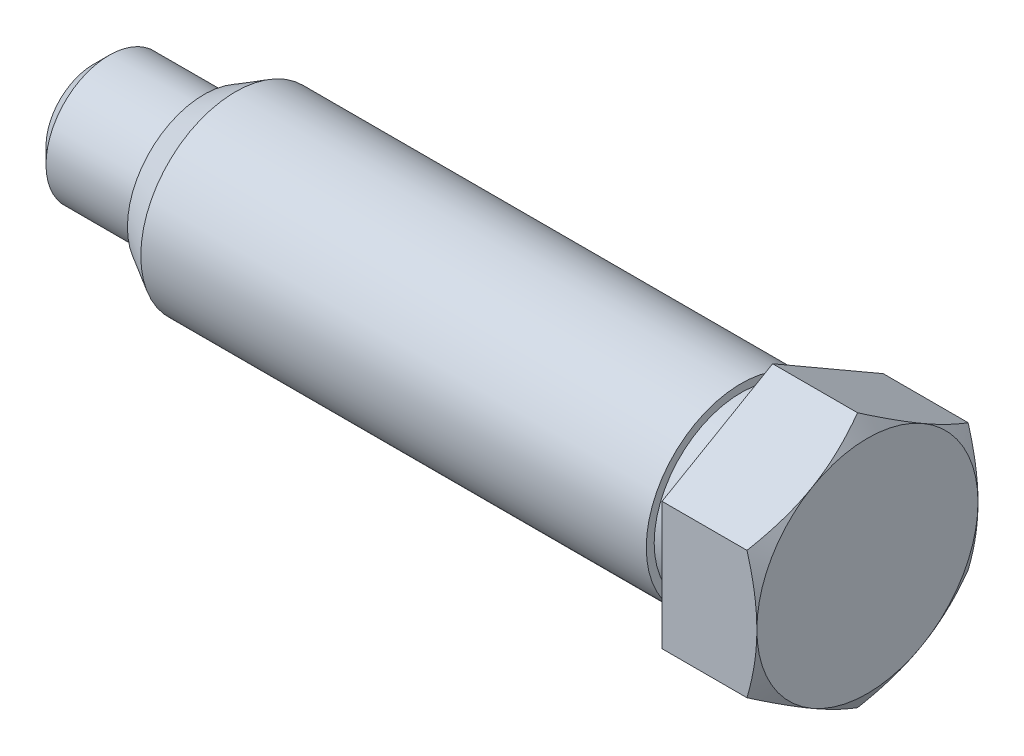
ISO-10303-21;
HEADER;
FILE_DESCRIPTION(('STEP AP214'),'2;1');
FILE_NAME('part.step','',(''),(''),'','','');
FILE_SCHEMA(('AUTOMOTIVE_DESIGN { 1 0 10303 214 1 1 1 1 }'));
ENDSEC;
DATA;
#1=APPLICATION_CONTEXT('core data for automotive mechanical design processes');
#2=APPLICATION_PROTOCOL_DEFINITION('international standard','automotive_design',2000,#1);
#3=PRODUCT_CONTEXT('',#1,'mechanical');
#4=PRODUCT('Part','Part','',(#3));
#5=PRODUCT_RELATED_PRODUCT_CATEGORY('part','',(#4));
#6=PRODUCT_DEFINITION_FORMATION('','',#4);
#7=PRODUCT_DEFINITION_CONTEXT('part definition',#1,'design');
#8=PRODUCT_DEFINITION('design','',#6,#7);
#9=PRODUCT_DEFINITION_SHAPE('','',#8);
#10=(LENGTH_UNIT() NAMED_UNIT(*) SI_UNIT(.MILLI.,.METRE.));
#11=(NAMED_UNIT(*) PLANE_ANGLE_UNIT() SI_UNIT($,.RADIAN.));
#12=(NAMED_UNIT(*) SI_UNIT($,.STERADIAN.) SOLID_ANGLE_UNIT());
#13=UNCERTAINTY_MEASURE_WITH_UNIT(LENGTH_MEASURE(1.E-05),#10,'distance_accuracy_value','');
#14=(GEOMETRIC_REPRESENTATION_CONTEXT(3) GLOBAL_UNCERTAINTY_ASSIGNED_CONTEXT((#13)) GLOBAL_UNIT_ASSIGNED_CONTEXT((#10,
#11,#12)) REPRESENTATION_CONTEXT('',''));
#15=CARTESIAN_POINT('',(0.,0.,0.));
#16=DIRECTION('',(0.,0.,1.));
#17=DIRECTION('',(1.,0.,0.));
#18=AXIS2_PLACEMENT_3D('',#15,#16,#17);
#19=CARTESIAN_POINT('',(-37.,5.5,0.));
#20=DIRECTION('',(1.,0.,0.));
#21=DIRECTION('',(0.,0.,-1.));
#22=AXIS2_PLACEMENT_3D('',#19,#20,#21);
#23=PLANE('',#22);
#24=CARTESIAN_POINT('',(-37.,0.,0.));
#25=DIRECTION('',(-1.,0.,0.));
#26=DIRECTION('',(0.,0.,1.));
#27=AXIS2_PLACEMENT_3D('',#24,#25,#26);
#28=CIRCLE('',#27,5.5);
#29=CARTESIAN_POINT('',(-37.,0.,5.5));
#30=VERTEX_POINT('',#29);
#31=EDGE_CURVE('E150',#30,#30,#28,.T.);
#32=ORIENTED_EDGE('',*,*,#31,.F.);
#33=EDGE_LOOP('',(#32));
#34=FACE_BOUND('',#33,.T.);
#35=DIRECTION('',(0.,0.499999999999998,-0.86602540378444));
#36=VECTOR('',#35,1.);
#37=CARTESIAN_POINT('',(-37.,-4.68717782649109,-5.88156986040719));
#38=LINE('',#37,#36);
#39=CARTESIAN_POINT('',(-37.,-8.08290376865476,0.));
#40=VERTEX_POINT('',#39);
#41=CARTESIAN_POINT('',(-37.,-4.04145188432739,-7.));
#42=VERTEX_POINT('',#41);
#43=EDGE_CURVE('E205',#40,#42,#38,.T.);
#44=ORIENTED_EDGE('',*,*,#43,.F.);
#45=DIRECTION('',(0.,-0.500000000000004,-0.866025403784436));
#46=VECTOR('',#45,1.);
#47=CARTESIAN_POINT('',(-37.,-4.68717782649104,5.88156986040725));
#48=LINE('',#47,#46);
#49=CARTESIAN_POINT('',(-37.,-4.04145188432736,7.));
#50=VERTEX_POINT('',#49);
#51=EDGE_CURVE('E112',#50,#40,#48,.T.);
#52=ORIENTED_EDGE('',*,*,#51,.F.);
#53=DIRECTION('',(0.,-1.,0.));
#54=VECTOR('',#53,1.);
#55=CARTESIAN_POINT('',(-37.,5.5,7.));
#56=LINE('',#55,#54);
#57=CARTESIAN_POINT('',(-37.,4.04145188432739,7.));
#58=VERTEX_POINT('',#57);
#59=EDGE_CURVE('E132',#58,#50,#56,.T.);
#60=ORIENTED_EDGE('',*,*,#59,.F.);
#61=DIRECTION('',(0.,-0.499999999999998,0.86602540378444));
#62=VECTOR('',#61,1.);
#63=CARTESIAN_POINT('',(-37.,7.43717782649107,1.11843013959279));
#64=LINE('',#63,#62);
#65=CARTESIAN_POINT('',(-37.,8.08290376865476,0.));
#66=VERTEX_POINT('',#65);
#67=EDGE_CURVE('E57',#66,#58,#64,.T.);
#68=ORIENTED_EDGE('',*,*,#67,.F.);
#69=DIRECTION('',(0.,0.500000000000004,0.866025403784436));
#70=VECTOR('',#69,1.);
#71=CARTESIAN_POINT('',(-37.,7.43717782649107,-1.11843013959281));
#72=LINE('',#71,#70);
#73=CARTESIAN_POINT('',(-37.,4.04145188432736,-7.));
#74=VERTEX_POINT('',#73);
#75=EDGE_CURVE('E247',#74,#66,#72,.T.);
#76=ORIENTED_EDGE('',*,*,#75,.F.);
#77=DIRECTION('',(0.,1.,0.));
#78=VECTOR('',#77,1.);
#79=CARTESIAN_POINT('',(-37.,5.5,-7.));
#80=LINE('',#79,#78);
#81=EDGE_CURVE('E190',#42,#74,#80,.T.);
#82=ORIENTED_EDGE('',*,*,#81,.F.);
#83=EDGE_LOOP('',(#44,#52,#60,#68,#76,#82));
#84=FACE_BOUND('',#83,.T.);
#85=ADVANCED_FACE('F34',(#34,#84),#23,.F.);
#86=CARTESIAN_POINT('',(-31.,0.,0.));
#87=DIRECTION('',(-1.,0.,0.));
#88=DIRECTION('',(0.,0.,1.));
#89=AXIS2_PLACEMENT_3D('',#86,#87,#88);
#90=CONICAL_SURFACE('',#89,7.,1.0471975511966);
#91=CARTESIAN_POINT('',(-31.6252814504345,-4.04133641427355,-7.0002));
#92=CARTESIAN_POINT('',(-31.5739998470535,-4.13017208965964,-6.84633209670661));
#93=CARTESIAN_POINT('',(-31.5250455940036,-4.21933898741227,-6.69189049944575));
#94=CARTESIAN_POINT('',(-31.4324327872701,-4.3983969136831,-6.38175307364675));
#95=CARTESIAN_POINT('',(-31.3887765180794,-4.48828823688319,-6.22605673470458));
#96=CARTESIAN_POINT('',(-31.2666115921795,-4.7594014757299,-5.75647483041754));
#97=CARTESIAN_POINT('',(-31.197125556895,-4.94169356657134,-5.4407356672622));
#98=CARTESIAN_POINT('',(-31.1156449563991,-5.21449036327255,-4.96823775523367));
#99=CARTESIAN_POINT('',(-31.0924334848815,-5.30417998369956,-4.81289077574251));
#100=CARTESIAN_POINT('',(-31.0535112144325,-5.48396448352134,-4.50149488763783));
#101=CARTESIAN_POINT('',(-31.0377997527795,-5.57405932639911,-4.34544604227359));
#102=CARTESIAN_POINT('',(-31.0142779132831,-5.75440548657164,-4.03307732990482));
#103=CARTESIAN_POINT('',(-31.0064585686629,-5.84465650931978,-3.87675797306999));
#104=CARTESIAN_POINT('',(-30.9988802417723,-6.02523694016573,-3.56398349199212));
#105=CARTESIAN_POINT('',(-30.999121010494,-6.11556634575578,-3.40752837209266));
#106=CARTESIAN_POINT('',(-31.0108597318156,-6.36303901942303,-2.97889312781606));
#107=CARTESIAN_POINT('',(-31.0305657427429,-6.52010127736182,-2.70685331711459));
#108=CARTESIAN_POINT('',(-31.0930534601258,-6.83318259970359,-2.16458055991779));
#109=CARTESIAN_POINT('',(-31.135856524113,-6.9892005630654,-1.89434952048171));
#110=CARTESIAN_POINT('',(-31.2428516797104,-7.30291195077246,-1.35098545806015));
#111=CARTESIAN_POINT('',(-31.3074970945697,-7.46056579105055,-1.07792099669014));
#112=CARTESIAN_POINT('',(-31.454216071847,-7.77352241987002,-0.535864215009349));
#113=CARTESIAN_POINT('',(-31.5362551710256,-7.92882921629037,-0.266864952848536));
#114=CARTESIAN_POINT('',(-31.6252814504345,-8.0830192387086,0.000200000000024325));
#115=B_SPLINE_CURVE_WITH_KNOTS('',3,(#91,#92,#93,#94,#95,#96,#97,#98,#99,#100,#101,#102,#103,
#104,#105,#106,#107,#108,#109,#110,#111,#112,#113,#114),.UNSPECIFIED.,.F.,.F.,(4,2,2,2,2,2,2,2,
2,2,2,4),(0.,0.554727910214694,1.10969417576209,2.2219327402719,2.76443041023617,
3.30688013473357,3.8487128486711,4.39052882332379,5.33376515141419,6.27787517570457,
7.24292418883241,8.20607866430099),.UNSPECIFIED.);
#116=CARTESIAN_POINT('',(-31.6252147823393,-4.04145188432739,-7.));
#117=VERTEX_POINT('',#116);
#118=CARTESIAN_POINT('',(-31.,-6.06217782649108,-3.49999999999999));
#119=VERTEX_POINT('',#118);
#120=EDGE_CURVE('E259',#117,#119,#115,.T.);
#121=ORIENTED_EDGE('',*,*,#120,.F.);
#122=CARTESIAN_POINT('',(-36.0562612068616,-14.1175476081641,-7.));
#123=CARTESIAN_POINT('',(-35.878791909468,-13.7743985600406,-7.));
#124=CARTESIAN_POINT('',(-35.7022877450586,-13.4307456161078,-7.));
#125=CARTESIAN_POINT('',(-35.3517233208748,-12.7421707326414,-7.));
#126=CARTESIAN_POINT('',(-35.1776632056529,-12.397248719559,-7.));
#127=CARTESIAN_POINT('',(-34.8321439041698,-11.705158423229,-7.));
#128=CARTESIAN_POINT('',(-34.6606912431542,-11.3579868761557,-7.));
#129=CARTESIAN_POINT('',(-34.3215136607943,-10.6618336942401,-7.));
#130=CARTESIAN_POINT('',(-34.1537886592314,-10.3128520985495,-7.));
#131=CARTESIAN_POINT('',(-33.8136341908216,-9.59280463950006,-7.));
#132=CARTESIAN_POINT('',(-33.6414778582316,-9.22160934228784,-7.));
#133=CARTESIAN_POINT('',(-33.3039168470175,-8.47612168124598,-7.));
#134=CARTESIAN_POINT('',(-33.1385125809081,-8.10182912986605,-7.));
#135=CARTESIAN_POINT('',(-32.8167244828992,-7.3497243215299,-7.));
#136=CARTESIAN_POINT('',(-32.6603334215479,-6.97191517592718,-7.));
#137=CARTESIAN_POINT('',(-32.3594041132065,-6.21163259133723,-7.));
#138=CARTESIAN_POINT('',(-32.2148640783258,-5.8291598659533,-7.));
#139=CARTESIAN_POINT('',(-31.9432897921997,-5.06293805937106,-7.));
#140=CARTESIAN_POINT('',(-31.8160729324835,-4.6792545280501,-7.));
#141=CARTESIAN_POINT('',(-31.582538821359,-3.90546502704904,-7.));
#142=CARTESIAN_POINT('',(-31.476222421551,-3.51535879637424,-7.));
#143=CARTESIAN_POINT('',(-31.2930474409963,-2.73628130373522,-7.));
#144=CARTESIAN_POINT('',(-31.2156434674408,-2.34744267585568,-7.));
#145=CARTESIAN_POINT('',(-31.1244121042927,-1.7603636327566,-7.));
#146=CARTESIAN_POINT('',(-31.0981470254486,-1.56402816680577,-7.));
#147=CARTESIAN_POINT('',(-31.0545822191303,-1.17037366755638,-7.));
#148=CARTESIAN_POINT('',(-31.0372815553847,-0.973054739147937,-7.));
#149=CARTESIAN_POINT('',(-31.0092736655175,-0.53237688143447,-7.));
#150=CARTESIAN_POINT('',(-31.0009953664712,-0.28885841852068,-7.));
#151=CARTESIAN_POINT('',(-30.9991739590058,0.198238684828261,-7.));
#152=CARTESIAN_POINT('',(-31.0056313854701,0.441817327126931,-7.));
#153=CARTESIAN_POINT('',(-31.0329784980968,0.928201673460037,-7.));
#154=CARTESIAN_POINT('',(-31.0538710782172,1.17100721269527,-7.));
#155=CARTESIAN_POINT('',(-31.1091669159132,1.65506190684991,-7.));
#156=CARTESIAN_POINT('',(-31.1435706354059,1.89631100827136,-7.));
#157=CARTESIAN_POINT('',(-31.2256876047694,2.38354553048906,-7.));
#158=CARTESIAN_POINT('',(-31.273750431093,2.62947140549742,-7.));
#159=CARTESIAN_POINT('',(-31.3810647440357,3.11884982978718,-7.));
#160=CARTESIAN_POINT('',(-31.4403165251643,3.36230231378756,-7.));
#161=CARTESIAN_POINT('',(-31.5683721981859,3.84680041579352,-7.));
#162=CARTESIAN_POINT('',(-31.6371811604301,4.08784468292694,-7.));
#163=CARTESIAN_POINT('',(-31.7828001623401,4.5674701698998,-7.));
#164=CARTESIAN_POINT('',(-31.8596097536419,4.80605152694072,-7.));
#165=CARTESIAN_POINT('',(-32.0843838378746,5.47209968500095,-7.));
#166=CARTESIAN_POINT('',(-32.2398579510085,5.89702916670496,-7.));
#167=CARTESIAN_POINT('',(-32.5663402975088,6.74091481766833,-7.));
#168=CARTESIAN_POINT('',(-32.7373529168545,7.1598692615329,-7.));
#169=CARTESIAN_POINT('',(-33.0908103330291,7.99336644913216,-7.));
#170=CARTESIAN_POINT('',(-33.273265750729,8.40790466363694,-7.));
#171=CARTESIAN_POINT('',(-33.6464819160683,9.23315066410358,-7.));
#172=CARTESIAN_POINT('',(-33.8372417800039,9.64385885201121,-7.));
#173=CARTESIAN_POINT('',(-34.2256412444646,10.4635987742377,-7.));
#174=CARTESIAN_POINT('',(-34.4233007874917,10.8726210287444,-7.));
#175=CARTESIAN_POINT('',(-34.8234523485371,11.6882996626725,-7.));
#176=CARTESIAN_POINT('',(-35.0259444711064,12.094955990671,-7.));
#177=CARTESIAN_POINT('',(-35.4345832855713,12.9061515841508,-7.));
#178=CARTESIAN_POINT('',(-35.6407279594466,13.3106918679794,-7.));
#179=CARTESIAN_POINT('',(-36.0559997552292,14.118232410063,-7.));
#180=CARTESIAN_POINT('',(-36.2651268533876,14.5212326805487,-7.));
#181=CARTESIAN_POINT('',(-36.8393126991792,15.6197415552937,-7.));
#182=CARTESIAN_POINT('',(-37.2067496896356,16.3140064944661,-7.));
#183=CARTESIAN_POINT('',(-37.9467083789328,17.6999493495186,-7.));
#184=CARTESIAN_POINT('',(-38.3192308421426,18.3916268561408,-7.));
#185=CARTESIAN_POINT('',(-39.0655016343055,19.7684289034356,-7.));
#186=CARTESIAN_POINT('',(-39.4392257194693,20.4535665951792,-7.));
#187=CARTESIAN_POINT('',(-40.0018406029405,21.4800820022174,-7.));
#188=CARTESIAN_POINT('',(-40.189700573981,21.8220255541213,-7.));
#189=CARTESIAN_POINT('',(-40.566027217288,22.5055779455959,-7.));
#190=CARTESIAN_POINT('',(-40.7544938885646,22.8471867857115,-7.));
#191=CARTESIAN_POINT('',(-40.9432241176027,23.1886499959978,-7.));
#192=B_SPLINE_CURVE_WITH_KNOTS('',3,(#122,#123,#124,#125,#126,#127,#128,#129,#130,#131,#132,
#133,#134,#135,#136,#137,#138,#139,#140,#141,#142,#143,#144,#145,#146,#147,#148,#149,#150,#151,
#152,#153,#154,#155,#156,#157,#158,#159,#160,#161,#162,#163,#164,#165,#166,#167,#168,#169,#170,
#171,#172,#173,#174,#175,#176,#177,#178,#179,#180,#181,#182,#183,#184,#185,#186,#187,#188,#189,
#190,#191),.UNSPECIFIED.,.F.,.F.,(4,2,2,2,2,2,2,2,2,2,2,2,2,2,2,2,2,2,2,2,2,2,2,2,2,2,2,2,2,2,2,
2,2,2,4),(0.,1.15897826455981,2.3180247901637,3.4796076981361,4.64116558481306,5.86863732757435,
7.09618395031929,8.32273185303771,9.54909437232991,10.7613184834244,11.9735919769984,
13.1616794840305,13.7557568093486,14.3497720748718,15.0802978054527,15.8108500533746,
16.5415488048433,17.2722725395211,18.0237060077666,18.7751592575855,19.5270127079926,
20.2788240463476,21.6357796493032,22.9931194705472,24.3517383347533,25.7102129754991,
27.0730061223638,28.4358287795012,29.7979206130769,31.1600016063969,33.5164749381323,
35.8733064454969,38.2146112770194,39.3850598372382,40.5555064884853),.UNSPECIFIED.);
#193=CARTESIAN_POINT('',(-31.,0.,-7.));
#194=VERTEX_POINT('',#193);
#195=EDGE_CURVE('E195',#194,#117,#192,.F.);
#196=ORIENTED_EDGE('',*,*,#195,.F.);
#197=CARTESIAN_POINT('',(-31.,0.,0.));
#198=DIRECTION('',(-1.,0.,0.));
#199=DIRECTION('',(0.,0.,1.));
#200=AXIS2_PLACEMENT_3D('',#197,#198,#199);
#201=CIRCLE('',#200,7.);
#202=EDGE_CURVE('E136',#194,#119,#201,.T.);
#203=ORIENTED_EDGE('',*,*,#202,.T.);
#204=EDGE_LOOP('',(#121,#196,#203));
#205=FACE_BOUND('',#204,.T.);
#206=ADVANCED_FACE('F211',(#205),#90,.T.);
#207=CARTESIAN_POINT('',(-31.6252147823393,-8.08290376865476,0.));
#208=VERTEX_POINT('',#207);
#209=EDGE_CURVE('E135',#119,#208,#115,.T.);
#210=ORIENTED_EDGE('',*,*,#209,.F.);
#211=CARTESIAN_POINT('',(-31.,-6.06217782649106,3.50000000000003));
#212=VERTEX_POINT('',#211);
#213=EDGE_CURVE('E127',#119,#212,#201,.T.);
#214=ORIENTED_EDGE('',*,*,#213,.T.);
#215=CARTESIAN_POINT('',(-31.6252814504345,-8.08301923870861,-0.000199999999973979));
#216=CARTESIAN_POINT('',(-31.5739998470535,-7.99418356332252,0.153667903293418));
#217=CARTESIAN_POINT('',(-31.5250455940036,-7.90501666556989,0.308109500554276));
#218=CARTESIAN_POINT('',(-31.4324327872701,-7.72595873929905,0.618246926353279));
#219=CARTESIAN_POINT('',(-31.3887765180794,-7.63606741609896,0.773943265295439));
#220=CARTESIAN_POINT('',(-31.2666115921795,-7.36495417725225,1.24352516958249));
#221=CARTESIAN_POINT('',(-31.197125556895,-7.18266208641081,1.55926433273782));
#222=CARTESIAN_POINT('',(-31.1156449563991,-6.9098652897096,2.03176224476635));
#223=CARTESIAN_POINT('',(-31.0924334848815,-6.82017566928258,2.18710922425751));
#224=CARTESIAN_POINT('',(-31.0535112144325,-6.6403911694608,2.49850511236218));
#225=CARTESIAN_POINT('',(-31.0377997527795,-6.55029632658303,2.65455395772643));
#226=CARTESIAN_POINT('',(-31.0142779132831,-6.3699501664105,2.96692267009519));
#227=CARTESIAN_POINT('',(-31.0064585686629,-6.27969914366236,3.12324202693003));
#228=CARTESIAN_POINT('',(-30.9988802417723,-6.09911871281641,3.43601650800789));
#229=CARTESIAN_POINT('',(-30.999121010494,-6.00878930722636,3.59247162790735));
#230=CARTESIAN_POINT('',(-31.0108597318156,-5.7613166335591,4.02110687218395));
#231=CARTESIAN_POINT('',(-31.0305657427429,-5.60425437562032,4.29314668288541));
#232=CARTESIAN_POINT('',(-31.0930534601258,-5.29117305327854,4.8354194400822));
#233=CARTESIAN_POINT('',(-31.135856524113,-5.13515508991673,5.10565047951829));
#234=CARTESIAN_POINT('',(-31.2428516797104,-4.82144370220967,5.64901454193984));
#235=CARTESIAN_POINT('',(-31.3074970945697,-4.66378986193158,5.92207900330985));
#236=CARTESIAN_POINT('',(-31.454216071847,-4.35083323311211,6.46413578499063));
#237=CARTESIAN_POINT('',(-31.5362551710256,-4.19552643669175,6.73313504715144));
#238=CARTESIAN_POINT('',(-31.6252814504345,-4.04133641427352,7.0002));
#239=B_SPLINE_CURVE_WITH_KNOTS('',3,(#215,#216,#217,#218,#219,#220,#221,#222,#223,#224,#225,
#226,#227,#228,#229,#230,#231,#232,#233,#234,#235,#236,#237,#238),.UNSPECIFIED.,.F.,.F.,(4,2,2,
2,2,2,2,2,2,2,2,4),(0.,0.554727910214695,1.10969417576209,2.2219327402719,2.76443041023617,
3.30688013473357,3.8487128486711,4.39052882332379,5.33376515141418,6.27787517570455,
7.24292418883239,8.20607866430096),.UNSPECIFIED.);
#240=EDGE_CURVE('E105',#208,#212,#239,.T.);
#241=ORIENTED_EDGE('',*,*,#240,.F.);
#242=EDGE_LOOP('',(#210,#214,#241));
#243=FACE_BOUND('',#242,.T.);
#244=ADVANCED_FACE('F134',(#243),#90,.T.);
#245=CARTESIAN_POINT('',(-31.6252147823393,-4.04145188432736,7.));
#246=VERTEX_POINT('',#245);
#247=EDGE_CURVE('E49',#212,#246,#239,.T.);
#248=ORIENTED_EDGE('',*,*,#247,.F.);
#249=CARTESIAN_POINT('',(-31.,0.,7.));
#250=VERTEX_POINT('',#249);
#251=EDGE_CURVE('E118',#212,#250,#201,.T.);
#252=ORIENTED_EDGE('',*,*,#251,.T.);
#253=CARTESIAN_POINT('',(-36.0562612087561,-14.1175476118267,7.));
#254=CARTESIAN_POINT('',(-35.878791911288,-13.7743985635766,7.));
#255=CARTESIAN_POINT('',(-35.7022877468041,-13.4307456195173,7.));
#256=CARTESIAN_POINT('',(-35.3517233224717,-12.7421707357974,7.));
#257=CARTESIAN_POINT('',(-35.1776632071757,-12.3972487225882,7.));
#258=CARTESIAN_POINT('',(-34.8321439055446,-11.7051584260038,7.));
#259=CARTESIAN_POINT('',(-34.6606912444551,-11.3579868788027,7.));
#260=CARTESIAN_POINT('',(-34.3215136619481,-10.6618336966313,7.));
#261=CARTESIAN_POINT('',(-34.1537886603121,-10.3128521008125,7.));
#262=CARTESIAN_POINT('',(-33.8136341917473,-9.59280464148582,7.));
#263=CARTESIAN_POINT('',(-33.6414778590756,-9.22160934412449,7.));
#264=CARTESIAN_POINT('',(-33.303916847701,-8.47612168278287,7.));
#265=CARTESIAN_POINT('',(-33.1385125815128,-8.10182913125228,7.));
#266=CARTESIAN_POINT('',(-32.8167244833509,-7.34972432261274,7.));
#267=CARTESIAN_POINT('',(-32.6603334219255,-6.97191517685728,7.));
#268=CARTESIAN_POINT('',(-32.3594041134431,-6.21163259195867,7.));
#269=CARTESIAN_POINT('',(-32.2148640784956,-5.82915986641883,7.));
#270=CARTESIAN_POINT('',(-31.9432897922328,-5.06293805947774,7.));
#271=CARTESIAN_POINT('',(-31.8160729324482,-4.67925452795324,7.));
#272=CARTESIAN_POINT('',(-31.5825388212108,-3.9054650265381,7.));
#273=CARTESIAN_POINT('',(-31.4762224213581,-3.51535879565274,7.));
#274=CARTESIAN_POINT('',(-31.2930474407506,-2.73628130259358,7.));
#275=CARTESIAN_POINT('',(-31.2156434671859,-2.34744267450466,7.));
#276=CARTESIAN_POINT('',(-31.1244121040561,-1.76036363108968,7.));
#277=CARTESIAN_POINT('',(-31.0981470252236,-1.56402816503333,7.));
#278=CARTESIAN_POINT('',(-31.0545822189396,-1.17037366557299,7.));
#279=CARTESIAN_POINT('',(-31.0372815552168,-0.973054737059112,7.));
#280=CARTESIAN_POINT('',(-31.0092736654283,-0.532376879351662,7.));
#281=CARTESIAN_POINT('',(-31.0009953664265,-0.288858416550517,7.));
#282=CARTESIAN_POINT('',(-30.9991739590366,0.198238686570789,7.));
#283=CARTESIAN_POINT('',(-31.0056313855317,0.441817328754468,7.));
#284=CARTESIAN_POINT('',(-31.0329784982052,0.928201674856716,7.));
#285=CARTESIAN_POINT('',(-31.0538710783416,1.17100721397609,7.));
#286=CARTESIAN_POINT('',(-31.109166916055,1.65506190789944,7.));
#287=CARTESIAN_POINT('',(-31.1435706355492,1.89631100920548,7.));
#288=CARTESIAN_POINT('',(-31.2256876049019,2.38354553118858,7.));
#289=CARTESIAN_POINT('',(-31.2737504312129,2.6294714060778,7.));
#290=CARTESIAN_POINT('',(-31.3810647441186,3.11884983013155,7.));
#291=CARTESIAN_POINT('',(-31.4403165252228,3.36230231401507,7.));
#292=CARTESIAN_POINT('',(-31.5683721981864,3.84680041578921,7.));
#293=CARTESIAN_POINT('',(-31.6371811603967,4.08784468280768,7.));
#294=CARTESIAN_POINT('',(-31.7828001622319,4.56747016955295,7.));
#295=CARTESIAN_POINT('',(-31.8596097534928,4.80605152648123,7.));
#296=CARTESIAN_POINT('',(-32.084383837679,5.47209968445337,7.));
#297=CARTESIAN_POINT('',(-32.2398579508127,5.89702916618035,7.));
#298=CARTESIAN_POINT('',(-32.5663402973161,6.74091481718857,7.));
#299=CARTESIAN_POINT('',(-32.737352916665,7.15986926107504,7.));
#300=CARTESIAN_POINT('',(-33.0908103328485,7.99336644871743,7.));
#301=CARTESIAN_POINT('',(-33.2732657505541,8.40790466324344,7.));
#302=CARTESIAN_POINT('',(-33.6464819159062,9.23315066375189,7.));
#303=CARTESIAN_POINT('',(-33.837241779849,9.64385885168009,7.));
#304=CARTESIAN_POINT('',(-34.2256412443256,10.4635987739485,7.));
#305=CARTESIAN_POINT('',(-34.4233007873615,10.8726210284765,7.));
#306=CARTESIAN_POINT('',(-34.8234523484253,11.688299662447,7.));
#307=CARTESIAN_POINT('',(-35.0259444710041,12.0949559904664,7.));
#308=CARTESIAN_POINT('',(-35.4345832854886,12.9061515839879,7.));
#309=CARTESIAN_POINT('',(-35.6407279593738,13.3106918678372,7.));
#310=CARTESIAN_POINT('',(-36.0559997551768,14.1182324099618,7.));
#311=CARTESIAN_POINT('',(-36.2651268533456,14.5212326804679,7.));
#312=CARTESIAN_POINT('',(-36.8393126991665,15.61974155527,7.));
#313=CARTESIAN_POINT('',(-37.2067496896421,16.3140064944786,7.));
#314=CARTESIAN_POINT('',(-37.9467083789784,17.6999493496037,7.));
#315=CARTESIAN_POINT('',(-38.3192308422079,18.391626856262,7.));
#316=CARTESIAN_POINT('',(-39.0655016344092,19.7684289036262,7.));
#317=CARTESIAN_POINT('',(-39.4392257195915,20.4535665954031,7.));
#318=CARTESIAN_POINT('',(-40.0018406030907,21.480082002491,7.));
#319=CARTESIAN_POINT('',(-40.1897005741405,21.8220255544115,7.));
#320=CARTESIAN_POINT('',(-40.5660272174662,22.5055779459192,7.));
#321=CARTESIAN_POINT('',(-40.7544938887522,22.8471867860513,7.));
#322=CARTESIAN_POINT('',(-40.9432241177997,23.1886499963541,7.));
#323=B_SPLINE_CURVE_WITH_KNOTS('',3,(#253,#254,#255,#256,#257,#258,#259,#260,#261,#262,#263,
#264,#265,#266,#267,#268,#269,#270,#271,#272,#273,#274,#275,#276,#277,#278,#279,#280,#281,#282,
#283,#284,#285,#286,#287,#288,#289,#290,#291,#292,#293,#294,#295,#296,#297,#298,#299,#300,#301,
#302,#303,#304,#305,#306,#307,#308,#309,#310,#311,#312,#313,#314,#315,#316,#317,#318,#319,#320,
#321,#322),.UNSPECIFIED.,.F.,.F.,(4,2,2,2,2,2,2,2,2,2,2,2,2,2,2,2,2,2,2,2,2,2,2,2,2,2,2,2,2,2,2,
2,2,2,4),(0.,1.15897826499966,2.31802479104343,3.4796076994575,4.64116558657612,
5.86863732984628,7.09618395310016,8.32273185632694,9.54909437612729,10.7613184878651,
11.9735919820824,13.1616794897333,13.7557568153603,14.3497720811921,15.0802978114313,
15.8108500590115,16.5415488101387,17.2722725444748,18.0237060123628,18.7751592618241,
19.5270127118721,20.2788240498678,21.6357796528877,22.9931194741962,24.3517383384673,
25.7102129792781,27.073006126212,28.4358287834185,29.797920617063,31.1600016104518,
33.5164749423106,35.8733064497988,38.2146112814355,39.3850598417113,40.5555064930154),.UNSPECIFIED.);
#324=EDGE_CURVE('E120',#246,#250,#323,.T.);
#325=ORIENTED_EDGE('',*,*,#324,.F.);
#326=EDGE_LOOP('',(#248,#252,#325));
#327=FACE_BOUND('',#326,.T.);
#328=ADVANCED_FACE('F117',(#327),#90,.T.);
#329=CARTESIAN_POINT('',(-31.6252814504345,4.04133641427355,7.0002));
#330=CARTESIAN_POINT('',(-31.5739998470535,4.13017208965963,6.84633209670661));
#331=CARTESIAN_POINT('',(-31.5250455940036,4.21933898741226,6.69189049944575));
#332=CARTESIAN_POINT('',(-31.4324327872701,4.3983969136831,6.38175307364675));
#333=CARTESIAN_POINT('',(-31.3887765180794,4.48828823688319,6.22605673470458));
#334=CARTESIAN_POINT('',(-31.2666115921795,4.7594014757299,5.75647483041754));
#335=CARTESIAN_POINT('',(-31.197125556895,4.94169356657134,5.4407356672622));
#336=CARTESIAN_POINT('',(-31.1156449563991,5.21449036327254,4.96823775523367));
#337=CARTESIAN_POINT('',(-31.0924334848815,5.30417998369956,4.81289077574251));
#338=CARTESIAN_POINT('',(-31.0535112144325,5.48396448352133,4.50149488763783));
#339=CARTESIAN_POINT('',(-31.0377997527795,5.57405932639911,4.34544604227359));
#340=CARTESIAN_POINT('',(-31.0142779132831,5.75440548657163,4.03307732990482));
#341=CARTESIAN_POINT('',(-31.0064585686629,5.84465650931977,3.87675797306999));
#342=CARTESIAN_POINT('',(-30.9988802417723,6.02523694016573,3.56398349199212));
#343=CARTESIAN_POINT('',(-30.999121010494,6.11556634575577,3.40752837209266));
#344=CARTESIAN_POINT('',(-31.0108597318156,6.36303901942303,2.97889312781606));
#345=CARTESIAN_POINT('',(-31.0305657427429,6.52010127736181,2.70685331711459));
#346=CARTESIAN_POINT('',(-31.0930534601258,6.83318259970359,2.16458055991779));
#347=CARTESIAN_POINT('',(-31.135856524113,6.9892005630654,1.89434952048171));
#348=CARTESIAN_POINT('',(-31.2428516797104,7.30291195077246,1.35098545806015));
#349=CARTESIAN_POINT('',(-31.3074970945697,7.46056579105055,1.07792099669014));
#350=CARTESIAN_POINT('',(-31.454216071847,7.77352241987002,0.535864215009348));
#351=CARTESIAN_POINT('',(-31.5362551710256,7.92882921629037,0.266864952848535));
#352=CARTESIAN_POINT('',(-31.6252814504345,8.0830192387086,-0.00020000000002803));
#353=B_SPLINE_CURVE_WITH_KNOTS('',3,(#329,#330,#331,#332,#333,#334,#335,#336,#337,#338,#339,
#340,#341,#342,#343,#344,#345,#346,#347,#348,#349,#350,#351,#352),.UNSPECIFIED.,.F.,.F.,(4,2,2,
2,2,2,2,2,2,2,2,4),(0.,0.554727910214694,1.10969417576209,2.2219327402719,2.76443041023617,
3.30688013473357,3.8487128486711,4.39052882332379,5.33376515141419,6.27787517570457,
7.24292418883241,8.20607866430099),.UNSPECIFIED.);
#354=CARTESIAN_POINT('',(-31.6252147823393,4.04145188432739,7.));
#355=VERTEX_POINT('',#354);
#356=CARTESIAN_POINT('',(-31.,6.06217782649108,3.49999999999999));
#357=VERTEX_POINT('',#356);
#358=EDGE_CURVE('E234',#355,#357,#353,.T.);
#359=ORIENTED_EDGE('',*,*,#358,.F.);
#360=EDGE_CURVE('E197',#250,#355,#323,.T.);
#361=ORIENTED_EDGE('',*,*,#360,.F.);
#362=EDGE_CURVE('E131',#250,#357,#201,.T.);
#363=ORIENTED_EDGE('',*,*,#362,.T.);
#364=EDGE_LOOP('',(#359,#361,#363));
#365=FACE_BOUND('',#364,.T.);
#366=ADVANCED_FACE('F274',(#365),#90,.T.);
#367=CARTESIAN_POINT('',(-31.6252147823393,8.08290376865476,0.));
#368=VERTEX_POINT('',#367);
#369=EDGE_CURVE('E246',#357,#368,#353,.T.);
#370=ORIENTED_EDGE('',*,*,#369,.F.);
#371=CARTESIAN_POINT('',(-31.,6.06217782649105,-3.50000000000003));
#372=VERTEX_POINT('',#371);
#373=EDGE_CURVE('E138',#357,#372,#201,.T.);
#374=ORIENTED_EDGE('',*,*,#373,.T.);
#375=CARTESIAN_POINT('',(-31.6252814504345,8.0830192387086,0.00019999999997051));
#376=CARTESIAN_POINT('',(-31.5739998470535,7.99418356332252,-0.153667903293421));
#377=CARTESIAN_POINT('',(-31.5250455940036,7.90501666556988,-0.308109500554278));
#378=CARTESIAN_POINT('',(-31.4324327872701,7.72595873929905,-0.618246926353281));
#379=CARTESIAN_POINT('',(-31.3887765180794,7.63606741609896,-0.773943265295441));
#380=CARTESIAN_POINT('',(-31.2666115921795,7.36495417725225,-1.24352516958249));
#381=CARTESIAN_POINT('',(-31.197125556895,7.18266208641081,-1.55926433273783));
#382=CARTESIAN_POINT('',(-31.1156449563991,6.9098652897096,-2.03176224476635));
#383=CARTESIAN_POINT('',(-31.0924334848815,6.82017566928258,-2.18710922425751));
#384=CARTESIAN_POINT('',(-31.0535112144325,6.6403911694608,-2.49850511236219));
#385=CARTESIAN_POINT('',(-31.0377997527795,6.55029632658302,-2.65455395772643));
#386=CARTESIAN_POINT('',(-31.0142779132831,6.3699501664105,-2.9669226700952));
#387=CARTESIAN_POINT('',(-31.0064585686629,6.27969914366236,-3.12324202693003));
#388=CARTESIAN_POINT('',(-30.9988802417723,6.0991187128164,-3.4360165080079));
#389=CARTESIAN_POINT('',(-30.999121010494,6.00878930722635,-3.59247162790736));
#390=CARTESIAN_POINT('',(-31.0108597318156,5.7613166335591,-4.02110687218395));
#391=CARTESIAN_POINT('',(-31.0305657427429,5.60425437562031,-4.29314668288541));
#392=CARTESIAN_POINT('',(-31.0930534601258,5.29117305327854,-4.83541944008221));
#393=CARTESIAN_POINT('',(-31.135856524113,5.13515508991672,-5.10565047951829));
#394=CARTESIAN_POINT('',(-31.2428516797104,4.82144370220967,-5.64901454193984));
#395=CARTESIAN_POINT('',(-31.3074970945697,4.66378986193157,-5.92207900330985));
#396=CARTESIAN_POINT('',(-31.454216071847,4.35083323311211,-6.46413578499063));
#397=CARTESIAN_POINT('',(-31.5362551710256,4.19552643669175,-6.73313504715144));
#398=CARTESIAN_POINT('',(-31.6252814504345,4.04133641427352,-7.0002));
#399=B_SPLINE_CURVE_WITH_KNOTS('',3,(#375,#376,#377,#378,#379,#380,#381,#382,#383,#384,#385,
#386,#387,#388,#389,#390,#391,#392,#393,#394,#395,#396,#397,#398),.UNSPECIFIED.,.F.,.F.,(4,2,2,
2,2,2,2,2,2,2,2,4),(0.,0.554727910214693,1.10969417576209,2.2219327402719,2.76443041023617,
3.30688013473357,3.8487128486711,4.39052882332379,5.33376515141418,6.27787517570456,
7.24292418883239,8.20607866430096),.UNSPECIFIED.);
#400=EDGE_CURVE('E245',#368,#372,#399,.T.);
#401=ORIENTED_EDGE('',*,*,#400,.F.);
#402=EDGE_LOOP('',(#370,#374,#401));
#403=FACE_BOUND('',#402,.T.);
#404=ADVANCED_FACE('F276',(#403),#90,.T.);
#405=CARTESIAN_POINT('',(-31.6252147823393,4.04145188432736,-7.));
#406=VERTEX_POINT('',#405);
#407=EDGE_CURVE('E194',#372,#406,#399,.T.);
#408=ORIENTED_EDGE('',*,*,#407,.F.);
#409=EDGE_CURVE('E137',#372,#194,#201,.T.);
#410=ORIENTED_EDGE('',*,*,#409,.T.);
#411=EDGE_CURVE('E187',#406,#194,#192,.F.);
#412=ORIENTED_EDGE('',*,*,#411,.F.);
#413=EDGE_LOOP('',(#408,#410,#412));
#414=FACE_BOUND('',#413,.T.);
#415=ADVANCED_FACE('F193',(#414),#90,.T.);
#416=CARTESIAN_POINT('',(-80.,10.,-7.));
#417=DIRECTION('',(0.,0.,-1.));
#418=DIRECTION('',(0.,1.,0.));
#419=AXIS2_PLACEMENT_3D('',#416,#417,#418);
#420=PLANE('',#419);
#421=ORIENTED_EDGE('',*,*,#195,.T.);
#422=DIRECTION('',(-1.,0.,0.));
#423=VECTOR('',#422,1.);
#424=CARTESIAN_POINT('',(-80.,-4.04145188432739,-7.));
#425=LINE('',#424,#423);
#426=EDGE_CURVE('E11',#117,#42,#425,.T.);
#427=ORIENTED_EDGE('',*,*,#426,.T.);
#428=ORIENTED_EDGE('',*,*,#81,.T.);
#429=DIRECTION('',(1.,0.,0.));
#430=VECTOR('',#429,1.);
#431=CARTESIAN_POINT('',(-80.,4.04145188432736,-7.));
#432=LINE('',#431,#430);
#433=EDGE_CURVE('E42',#74,#406,#432,.T.);
#434=ORIENTED_EDGE('',*,*,#433,.T.);
#435=ORIENTED_EDGE('',*,*,#411,.T.);
#436=EDGE_LOOP('',(#421,#427,#428,#434,#435));
#437=FACE_BOUND('',#436,.T.);
#438=ADVANCED_FACE('F186',(#437),#420,.T.);
#439=CARTESIAN_POINT('',(-80.,10.,7.));
#440=DIRECTION('',(0.,0.,1.));
#441=DIRECTION('',(0.,-1.,0.));
#442=AXIS2_PLACEMENT_3D('',#439,#440,#441);
#443=PLANE('',#442);
#444=ORIENTED_EDGE('',*,*,#360,.T.);
#445=DIRECTION('',(-1.,0.,0.));
#446=VECTOR('',#445,1.);
#447=CARTESIAN_POINT('',(-80.,4.04145188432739,7.));
#448=LINE('',#447,#446);
#449=EDGE_CURVE('E181',#355,#58,#448,.T.);
#450=ORIENTED_EDGE('',*,*,#449,.T.);
#451=ORIENTED_EDGE('',*,*,#59,.T.);
#452=DIRECTION('',(1.,0.,0.));
#453=VECTOR('',#452,1.);
#454=CARTESIAN_POINT('',(-80.,-4.04145188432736,7.));
#455=LINE('',#454,#453);
#456=EDGE_CURVE('E179',#50,#246,#455,.T.);
#457=ORIENTED_EDGE('',*,*,#456,.T.);
#458=ORIENTED_EDGE('',*,*,#324,.T.);
#459=EDGE_LOOP('',(#444,#450,#451,#457,#458));
#460=FACE_BOUND('',#459,.T.);
#461=ADVANCED_FACE('F273',(#460),#443,.T.);
#462=CARTESIAN_POINT('',(-80.,0.,0.));
#463=DIRECTION('',(1.,0.,0.));
#464=DIRECTION('',(0.,0.,-1.));
#465=AXIS2_PLACEMENT_3D('',#462,#463,#464);
#466=PLANE('',#465);
#467=CARTESIAN_POINT('',(-80.,0.,0.));
#468=DIRECTION('',(1.,0.,0.));
#469=DIRECTION('',(0.,0.,-1.));
#470=AXIS2_PLACEMENT_3D('',#467,#468,#469);
#471=CIRCLE('',#470,2.99999999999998);
#472=CARTESIAN_POINT('',(-80.,0.,-2.99999999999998));
#473=VERTEX_POINT('',#472);
#474=EDGE_CURVE('E173',#473,#473,#471,.F.);
#475=ORIENTED_EDGE('',*,*,#474,.T.);
#476=EDGE_LOOP('',(#475));
#477=FACE_BOUND('',#476,.T.);
#478=ADVANCED_FACE('F36',(#477),#466,.F.);
#479=CARTESIAN_POINT('',(-100.,0.,0.));
#480=DIRECTION('',(-1.,0.,0.));
#481=DIRECTION('',(0.,0.,1.));
#482=AXIS2_PLACEMENT_3D('',#479,#480,#481);
#483=CYLINDRICAL_SURFACE('',#482,4.);
#484=CARTESIAN_POINT('',(-79.,0.,0.));
#485=DIRECTION('',(1.,0.,0.));
#486=DIRECTION('',(0.,0.,-1.));
#487=AXIS2_PLACEMENT_3D('',#484,#485,#486);
#488=CIRCLE('',#487,4.);
#489=CARTESIAN_POINT('',(-79.,0.,-4.));
#490=VERTEX_POINT('',#489);
#491=EDGE_CURVE('E176',#490,#490,#488,.T.);
#492=ORIENTED_EDGE('',*,*,#491,.T.);
#493=EDGE_LOOP('',(#492));
#494=FACE_BOUND('',#493,.T.);
#495=CARTESIAN_POINT('',(-73.,0.,0.));
#496=DIRECTION('',(-1.,0.,0.));
#497=DIRECTION('',(0.,0.,1.));
#498=AXIS2_PLACEMENT_3D('',#495,#496,#497);
#499=CIRCLE('',#498,4.);
#500=CARTESIAN_POINT('',(-73.,0.,4.));
#501=VERTEX_POINT('',#500);
#502=EDGE_CURVE('E170',#501,#501,#499,.T.);
#503=ORIENTED_EDGE('',*,*,#502,.T.);
#504=EDGE_LOOP('',(#503));
#505=FACE_BOUND('',#504,.T.);
#506=ADVANCED_FACE('F339',(#494,#505),#483,.T.);
#507=CARTESIAN_POINT('',(-73.,4.,0.));
#508=DIRECTION('',(1.,0.,0.));
#509=DIRECTION('',(0.,0.,-1.));
#510=AXIS2_PLACEMENT_3D('',#507,#508,#509);
#511=PLANE('',#510);
#512=ORIENTED_EDGE('',*,*,#502,.F.);
#513=EDGE_LOOP('',(#512));
#514=FACE_BOUND('',#513,.T.);
#515=CARTESIAN_POINT('',(-73.,0.,0.));
#516=DIRECTION('',(-1.,0.,0.));
#517=DIRECTION('',(0.,0.,1.));
#518=AXIS2_PLACEMENT_3D('',#515,#516,#517);
#519=CIRCLE('',#518,4.84529946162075);
#520=CARTESIAN_POINT('',(-73.,0.,4.84529946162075));
#521=VERTEX_POINT('',#520);
#522=EDGE_CURVE('E167',#521,#521,#519,.T.);
#523=ORIENTED_EDGE('',*,*,#522,.T.);
#524=EDGE_LOOP('',(#523));
#525=FACE_BOUND('',#524,.T.);
#526=ADVANCED_FACE('F348',(#514,#525),#511,.F.);
#527=CARTESIAN_POINT('',(-71.,0.,0.));
#528=DIRECTION('',(1.,0.,0.));
#529=DIRECTION('',(0.,0.,-1.));
#530=AXIS2_PLACEMENT_3D('',#527,#528,#529);
#531=CONICAL_SURFACE('',#530,6.,0.5235987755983);
#532=ORIENTED_EDGE('',*,*,#522,.F.);
#533=EDGE_LOOP('',(#532));
#534=FACE_BOUND('',#533,.T.);
#535=CARTESIAN_POINT('',(-71.,0.,0.));
#536=DIRECTION('',(-1.,0.,0.));
#537=DIRECTION('',(0.,0.,1.));
#538=AXIS2_PLACEMENT_3D('',#535,#536,#537);
#539=CIRCLE('',#538,6.);
#540=CARTESIAN_POINT('',(-71.,0.,6.));
#541=VERTEX_POINT('',#540);
#542=EDGE_CURVE('E164',#541,#541,#539,.T.);
#543=ORIENTED_EDGE('',*,*,#542,.T.);
#544=EDGE_LOOP('',(#543));
#545=FACE_BOUND('',#544,.T.);
#546=ADVANCED_FACE('F357',(#534,#545),#531,.T.);
#547=CARTESIAN_POINT('',(-100.,0.,0.));
#548=DIRECTION('',(-1.,0.,0.));
#549=DIRECTION('',(0.,0.,1.));
#550=AXIS2_PLACEMENT_3D('',#547,#548,#549);
#551=CYLINDRICAL_SURFACE('',#550,6.);
#552=ORIENTED_EDGE('',*,*,#542,.F.);
#553=EDGE_LOOP('',(#552));
#554=FACE_BOUND('',#553,.T.);
#555=CARTESIAN_POINT('',(-39.,0.,0.));
#556=DIRECTION('',(-1.,0.,0.));
#557=DIRECTION('',(0.,0.,1.));
#558=AXIS2_PLACEMENT_3D('',#555,#556,#557);
#559=CIRCLE('',#558,6.);
#560=CARTESIAN_POINT('',(-39.,0.,6.));
#561=VERTEX_POINT('',#560);
#562=EDGE_CURVE('E159',#561,#561,#559,.T.);
#563=ORIENTED_EDGE('',*,*,#562,.T.);
#564=EDGE_LOOP('',(#563));
#565=FACE_BOUND('',#564,.T.);
#566=ADVANCED_FACE('F367',(#554,#565),#551,.T.);
#567=CARTESIAN_POINT('',(-39.,6.,0.));
#568=DIRECTION('',(-1.,0.,0.));
#569=DIRECTION('',(0.,0.,1.));
#570=AXIS2_PLACEMENT_3D('',#567,#568,#569);
#571=PLANE('',#570);
#572=ORIENTED_EDGE('',*,*,#562,.F.);
#573=EDGE_LOOP('',(#572));
#574=FACE_BOUND('',#573,.T.);
#575=CARTESIAN_POINT('',(-39.,0.,0.));
#576=DIRECTION('',(-1.,0.,0.));
#577=DIRECTION('',(0.,0.,1.));
#578=AXIS2_PLACEMENT_3D('',#575,#576,#577);
#579=CIRCLE('',#578,5.5);
#580=CARTESIAN_POINT('',(-39.,0.,5.5));
#581=VERTEX_POINT('',#580);
#582=EDGE_CURVE('E155',#581,#581,#579,.T.);
#583=ORIENTED_EDGE('',*,*,#582,.T.);
#584=EDGE_LOOP('',(#583));
#585=FACE_BOUND('',#584,.T.);
#586=ADVANCED_FACE('F378',(#574,#585),#571,.F.);
#587=CARTESIAN_POINT('',(-100.,0.,0.));
#588=DIRECTION('',(-1.,0.,0.));
#589=DIRECTION('',(0.,0.,1.));
#590=AXIS2_PLACEMENT_3D('',#587,#588,#589);
#591=CYLINDRICAL_SURFACE('',#590,5.5);
#592=ORIENTED_EDGE('',*,*,#582,.F.);
#593=EDGE_LOOP('',(#592));
#594=FACE_BOUND('',#593,.T.);
#595=ORIENTED_EDGE('',*,*,#31,.T.);
#596=EDGE_LOOP('',(#595));
#597=FACE_BOUND('',#596,.T.);
#598=ADVANCED_FACE('F388',(#594,#597),#591,.T.);
#599=CARTESIAN_POINT('',(-31.,7.,0.));
#600=DIRECTION('',(-1.,0.,0.));
#601=DIRECTION('',(0.,0.,1.));
#602=AXIS2_PLACEMENT_3D('',#599,#600,#601);
#603=PLANE('',#602);
#604=ORIENTED_EDGE('',*,*,#362,.F.);
#605=ORIENTED_EDGE('',*,*,#251,.F.);
#606=ORIENTED_EDGE('',*,*,#213,.F.);
#607=ORIENTED_EDGE('',*,*,#202,.F.);
#608=ORIENTED_EDGE('',*,*,#409,.F.);
#609=ORIENTED_EDGE('',*,*,#373,.F.);
#610=EDGE_LOOP('',(#604,#605,#606,#607,#608,#609));
#611=FACE_BOUND('',#610,.T.);
#612=ADVANCED_FACE('F125',(#611),#603,.F.);
#613=CARTESIAN_POINT('',(-80.,0.,0.));
#614=DIRECTION('',(1.,0.,0.));
#615=DIRECTION('',(0.,0.,-1.));
#616=AXIS2_PLACEMENT_3D('',#613,#614,#615);
#617=CONICAL_SURFACE('',#616,2.99999999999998,0.785398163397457);
#618=ORIENTED_EDGE('',*,*,#491,.F.);
#619=EDGE_LOOP('',(#618));
#620=FACE_BOUND('',#619,.T.);
#621=ORIENTED_EDGE('',*,*,#474,.F.);
#622=EDGE_LOOP('',(#621));
#623=FACE_BOUND('',#622,.T.);
#624=ADVANCED_FACE('F406',(#620,#623),#617,.T.);
#625=CARTESIAN_POINT('',(-80.,-11.0621778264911,-5.16025403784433));
#626=DIRECTION('',(0.,-0.866025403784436,0.500000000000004));
#627=DIRECTION('',(0.,-0.500000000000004,-0.866025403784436));
#628=AXIS2_PLACEMENT_3D('',#625,#626,#627);
#629=PLANE('',#628);
#630=ORIENTED_EDGE('',*,*,#51,.T.);
#631=DIRECTION('',(-1.,0.,0.));
#632=VECTOR('',#631,1.);
#633=CARTESIAN_POINT('',(-80.,-8.08290376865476,0.));
#634=LINE('',#633,#632);
#635=EDGE_CURVE('E108',#208,#40,#634,.T.);
#636=ORIENTED_EDGE('',*,*,#635,.F.);
#637=ORIENTED_EDGE('',*,*,#240,.T.);
#638=ORIENTED_EDGE('',*,*,#247,.T.);
#639=ORIENTED_EDGE('',*,*,#456,.F.);
#640=EDGE_LOOP('',(#630,#636,#637,#638,#639));
#641=FACE_BOUND('',#640,.T.);
#642=ADVANCED_FACE('F106',(#641),#629,.T.);
#643=CARTESIAN_POINT('',(-80.,-1.0621778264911,-12.1602540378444));
#644=DIRECTION('',(0.,-0.86602540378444,-0.499999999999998));
#645=DIRECTION('',(0.,0.499999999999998,-0.86602540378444));
#646=AXIS2_PLACEMENT_3D('',#643,#644,#645);
#647=PLANE('',#646);
#648=ORIENTED_EDGE('',*,*,#209,.T.);
#649=ORIENTED_EDGE('',*,*,#635,.T.);
#650=ORIENTED_EDGE('',*,*,#43,.T.);
#651=ORIENTED_EDGE('',*,*,#426,.F.);
#652=ORIENTED_EDGE('',*,*,#120,.T.);
#653=EDGE_LOOP('',(#648,#649,#650,#651,#652));
#654=FACE_BOUND('',#653,.T.);
#655=ADVANCED_FACE('F253',(#654),#647,.T.);
#656=CARTESIAN_POINT('',(-80.,1.06217782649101,-12.1602540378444));
#657=DIRECTION('',(0.,0.866025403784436,-0.500000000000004));
#658=DIRECTION('',(0.,0.500000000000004,0.866025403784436));
#659=AXIS2_PLACEMENT_3D('',#656,#657,#658);
#660=PLANE('',#659);
#661=ORIENTED_EDGE('',*,*,#75,.T.);
#662=DIRECTION('',(-1.,0.,0.));
#663=VECTOR('',#662,1.);
#664=CARTESIAN_POINT('',(-80.,8.08290376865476,0.));
#665=LINE('',#664,#663);
#666=EDGE_CURVE('E121',#368,#66,#665,.T.);
#667=ORIENTED_EDGE('',*,*,#666,.F.);
#668=ORIENTED_EDGE('',*,*,#400,.T.);
#669=ORIENTED_EDGE('',*,*,#407,.T.);
#670=ORIENTED_EDGE('',*,*,#433,.F.);
#671=EDGE_LOOP('',(#661,#667,#668,#669,#670));
#672=FACE_BOUND('',#671,.T.);
#673=ADVANCED_FACE('F248',(#672),#660,.T.);
#674=CARTESIAN_POINT('',(-80.,11.0621778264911,-5.16025403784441));
#675=DIRECTION('',(0.,0.86602540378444,0.499999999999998));
#676=DIRECTION('',(0.,-0.499999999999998,0.86602540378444));
#677=AXIS2_PLACEMENT_3D('',#674,#675,#676);
#678=PLANE('',#677);
#679=ORIENTED_EDGE('',*,*,#369,.T.);
#680=ORIENTED_EDGE('',*,*,#666,.T.);
#681=ORIENTED_EDGE('',*,*,#67,.T.);
#682=ORIENTED_EDGE('',*,*,#449,.F.);
#683=ORIENTED_EDGE('',*,*,#358,.T.);
#684=EDGE_LOOP('',(#679,#680,#681,#682,#683));
#685=FACE_BOUND('',#684,.T.);
#686=ADVANCED_FACE('F252',(#685),#678,.T.);
#687=CLOSED_SHELL('',(#85,#206,#244,#328,#366,#404,#415,#438,#461,#478,#506,#526,#546,#566,#586,
#598,#612,#624,#642,#655,#673,#686));
#688=MANIFOLD_SOLID_BREP('B2',#687);
#689=ADVANCED_BREP_SHAPE_REPRESENTATION('',(#18,#688),#14);
#690=SHAPE_DEFINITION_REPRESENTATION(#9,#689);
ENDSEC;
END-ISO-10303-21;
